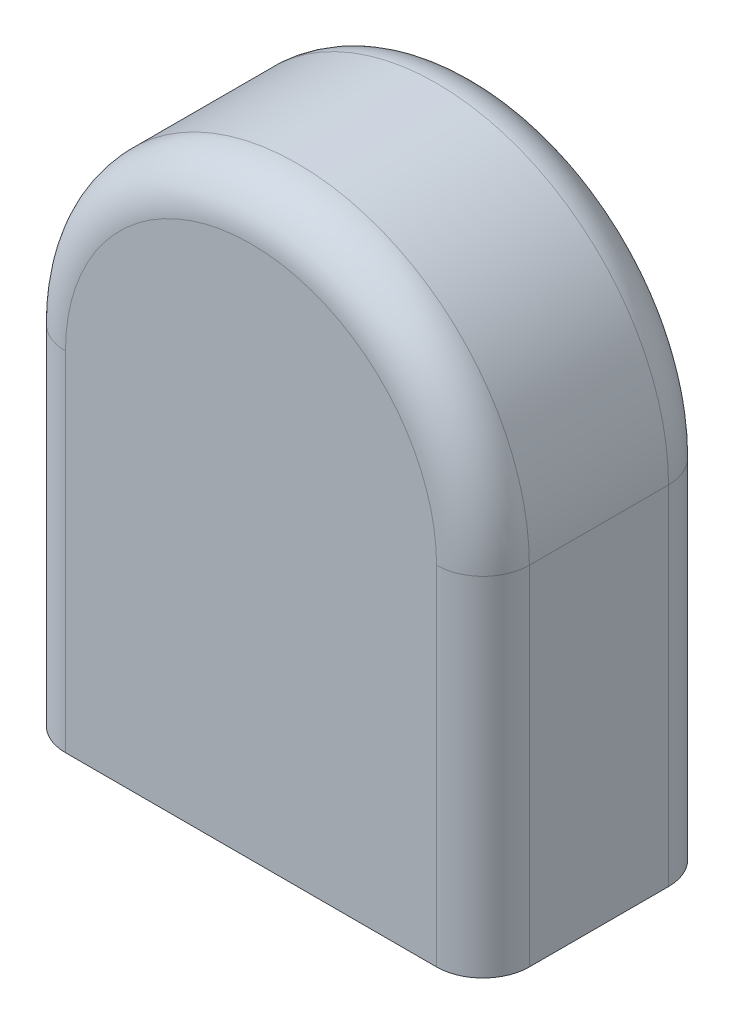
ISO-10303-21;
HEADER;
FILE_DESCRIPTION(('STEP AP214'),'2;1');
FILE_NAME('part.step','',(''),(''),'','','');
FILE_SCHEMA(('AUTOMOTIVE_DESIGN { 1 0 10303 214 1 1 1 1 }'));
ENDSEC;
DATA;
#1=APPLICATION_CONTEXT('core data for automotive mechanical design processes');
#2=APPLICATION_PROTOCOL_DEFINITION('international standard','automotive_design',2000,#1);
#3=PRODUCT_CONTEXT('',#1,'mechanical');
#4=PRODUCT('Part','Part','',(#3));
#5=PRODUCT_RELATED_PRODUCT_CATEGORY('part','',(#4));
#6=PRODUCT_DEFINITION_FORMATION('','',#4);
#7=PRODUCT_DEFINITION_CONTEXT('part definition',#1,'design');
#8=PRODUCT_DEFINITION('design','',#6,#7);
#9=PRODUCT_DEFINITION_SHAPE('','',#8);
#10=(LENGTH_UNIT() NAMED_UNIT(*) SI_UNIT(.MILLI.,.METRE.));
#11=(NAMED_UNIT(*) PLANE_ANGLE_UNIT() SI_UNIT($,.RADIAN.));
#12=(NAMED_UNIT(*) SI_UNIT($,.STERADIAN.) SOLID_ANGLE_UNIT());
#13=UNCERTAINTY_MEASURE_WITH_UNIT(LENGTH_MEASURE(1.E-05),#10,'distance_accuracy_value','');
#14=(GEOMETRIC_REPRESENTATION_CONTEXT(3) GLOBAL_UNCERTAINTY_ASSIGNED_CONTEXT((#13)) GLOBAL_UNIT_ASSIGNED_CONTEXT((#10,
#11,#12)) REPRESENTATION_CONTEXT('',''));
#15=CARTESIAN_POINT('',(0.,0.,0.));
#16=DIRECTION('',(0.,0.,1.));
#17=DIRECTION('',(1.,0.,0.));
#18=AXIS2_PLACEMENT_3D('',#15,#16,#17);
#19=CARTESIAN_POINT('',(-6.35,0.,3.175));
#20=DIRECTION('',(1.,0.,0.));
#21=DIRECTION('',(0.,1.,0.));
#22=AXIS2_PLACEMENT_3D('',#19,#20,#21);
#23=PLANE('',#22);
#24=DIRECTION('',(0.,0.,-1.));
#25=VECTOR('',#24,1.);
#26=CARTESIAN_POINT('',(-6.35,0.,3.175));
#27=LINE('',#26,#25);
#28=CARTESIAN_POINT('',(-6.35,0.,1.905));
#29=VERTEX_POINT('',#28);
#30=CARTESIAN_POINT('',(-6.35,0.,-1.905));
#31=VERTEX_POINT('',#30);
#32=EDGE_CURVE('E135',#29,#31,#27,.T.);
#33=ORIENTED_EDGE('',*,*,#32,.F.);
#34=DIRECTION('',(0.,-1.,0.));
#35=VECTOR('',#34,1.);
#36=CARTESIAN_POINT('',(-6.35,0.,1.905));
#37=LINE('',#36,#35);
#38=CARTESIAN_POINT('',(-6.35,9.525,1.905));
#39=VERTEX_POINT('',#38);
#40=EDGE_CURVE('E99',#29,#39,#37,.F.);
#41=ORIENTED_EDGE('',*,*,#40,.T.);
#42=DIRECTION('',(0.,0.,-1.));
#43=VECTOR('',#42,1.);
#44=CARTESIAN_POINT('',(-6.35,9.525,3.175));
#45=LINE('',#44,#43);
#46=CARTESIAN_POINT('',(-6.35,9.525,-1.905));
#47=VERTEX_POINT('',#46);
#48=EDGE_CURVE('E121',#39,#47,#45,.T.);
#49=ORIENTED_EDGE('',*,*,#48,.T.);
#50=DIRECTION('',(0.,-1.,0.));
#51=VECTOR('',#50,1.);
#52=CARTESIAN_POINT('',(-6.35,0.,-1.905));
#53=LINE('',#52,#51);
#54=EDGE_CURVE('E104',#47,#31,#53,.T.);
#55=ORIENTED_EDGE('',*,*,#54,.T.);
#56=EDGE_LOOP('',(#33,#41,#49,#55));
#57=FACE_BOUND('',#56,.T.);
#58=ADVANCED_FACE('F28',(#57),#23,.F.);
#59=CARTESIAN_POINT('',(-6.35,0.,3.175));
#60=DIRECTION('',(0.,1.,0.));
#61=DIRECTION('',(-1.,0.,0.));
#62=AXIS2_PLACEMENT_3D('',#59,#60,#61);
#63=PLANE('',#62);
#64=DIRECTION('',(1.,0.,0.));
#65=VECTOR('',#64,1.);
#66=CARTESIAN_POINT('',(-6.35,0.,3.175));
#67=LINE('',#66,#65);
#68=CARTESIAN_POINT('',(-5.08,0.,3.175));
#69=VERTEX_POINT('',#68);
#70=CARTESIAN_POINT('',(5.08,0.,3.175));
#71=VERTEX_POINT('',#70);
#72=EDGE_CURVE('E110',#69,#71,#67,.T.);
#73=ORIENTED_EDGE('',*,*,#72,.F.);
#74=CARTESIAN_POINT('',(-5.08,0.,1.905));
#75=DIRECTION('',(0.,1.,0.));
#76=DIRECTION('',(-1.,0.,0.));
#77=AXIS2_PLACEMENT_3D('',#74,#75,#76);
#78=CIRCLE('',#77,1.27);
#79=EDGE_CURVE('E94',#69,#29,#78,.F.);
#80=ORIENTED_EDGE('',*,*,#79,.T.);
#81=ORIENTED_EDGE('',*,*,#32,.T.);
#82=CARTESIAN_POINT('',(-5.08,0.,-1.905));
#83=DIRECTION('',(0.,1.,0.));
#84=DIRECTION('',(-1.,0.,0.));
#85=AXIS2_PLACEMENT_3D('',#82,#83,#84);
#86=CIRCLE('',#85,1.27);
#87=CARTESIAN_POINT('',(-5.08,0.,-3.175));
#88=VERTEX_POINT('',#87);
#89=EDGE_CURVE('E105',#31,#88,#86,.F.);
#90=ORIENTED_EDGE('',*,*,#89,.T.);
#91=DIRECTION('',(1.,0.,0.));
#92=VECTOR('',#91,1.);
#93=CARTESIAN_POINT('',(-6.35,0.,-3.175));
#94=LINE('',#93,#92);
#95=CARTESIAN_POINT('',(5.08,0.,-3.175));
#96=VERTEX_POINT('',#95);
#97=EDGE_CURVE('E122',#88,#96,#94,.T.);
#98=ORIENTED_EDGE('',*,*,#97,.T.);
#99=CARTESIAN_POINT('',(5.08,0.,-1.905));
#100=DIRECTION('',(0.,1.,0.));
#101=DIRECTION('',(-1.,0.,0.));
#102=AXIS2_PLACEMENT_3D('',#99,#100,#101);
#103=CIRCLE('',#102,1.27);
#104=CARTESIAN_POINT('',(6.35,0.,-1.905));
#105=VERTEX_POINT('',#104);
#106=EDGE_CURVE('E115',#96,#105,#103,.F.);
#107=ORIENTED_EDGE('',*,*,#106,.T.);
#108=DIRECTION('',(0.,0.,-1.));
#109=VECTOR('',#108,1.);
#110=CARTESIAN_POINT('',(6.35,0.,3.175));
#111=LINE('',#110,#109);
#112=CARTESIAN_POINT('',(6.35,0.,1.905));
#113=VERTEX_POINT('',#112);
#114=EDGE_CURVE('E133',#113,#105,#111,.T.);
#115=ORIENTED_EDGE('',*,*,#114,.F.);
#116=CARTESIAN_POINT('',(5.08,0.,1.905));
#117=DIRECTION('',(0.,1.,0.));
#118=DIRECTION('',(-1.,0.,0.));
#119=AXIS2_PLACEMENT_3D('',#116,#117,#118);
#120=CIRCLE('',#119,1.27);
#121=EDGE_CURVE('E120',#113,#71,#120,.F.);
#122=ORIENTED_EDGE('',*,*,#121,.T.);
#123=EDGE_LOOP('',(#73,#80,#81,#90,#98,#107,#115,#122));
#124=FACE_BOUND('',#123,.T.);
#125=ADVANCED_FACE('F117',(#124),#63,.F.);
#126=CARTESIAN_POINT('',(6.35,0.,3.175));
#127=DIRECTION('',(-1.,0.,0.));
#128=DIRECTION('',(0.,-1.,0.));
#129=AXIS2_PLACEMENT_3D('',#126,#127,#128);
#130=PLANE('',#129);
#131=DIRECTION('',(0.,0.,-1.));
#132=VECTOR('',#131,1.);
#133=CARTESIAN_POINT('',(6.35,9.525,3.175));
#134=LINE('',#133,#132);
#135=CARTESIAN_POINT('',(6.35,9.525,1.905));
#136=VERTEX_POINT('',#135);
#137=CARTESIAN_POINT('',(6.35,9.525,-1.905));
#138=VERTEX_POINT('',#137);
#139=EDGE_CURVE('E125',#136,#138,#134,.T.);
#140=ORIENTED_EDGE('',*,*,#139,.F.);
#141=DIRECTION('',(0.,1.,0.));
#142=VECTOR('',#141,1.);
#143=CARTESIAN_POINT('',(6.35,0.,1.905));
#144=LINE('',#143,#142);
#145=EDGE_CURVE('E156',#136,#113,#144,.F.);
#146=ORIENTED_EDGE('',*,*,#145,.T.);
#147=ORIENTED_EDGE('',*,*,#114,.T.);
#148=DIRECTION('',(0.,1.,0.));
#149=VECTOR('',#148,1.);
#150=CARTESIAN_POINT('',(6.35,9.525,-1.905));
#151=LINE('',#150,#149);
#152=EDGE_CURVE('E42',#105,#138,#151,.T.);
#153=ORIENTED_EDGE('',*,*,#152,.T.);
#154=EDGE_LOOP('',(#140,#146,#147,#153));
#155=FACE_BOUND('',#154,.T.);
#156=ADVANCED_FACE('F195',(#155),#130,.F.);
#157=CARTESIAN_POINT('',(0.,9.525,3.175));
#158=DIRECTION('',(0.,0.,-1.));
#159=DIRECTION('',(-1.,0.,0.));
#160=AXIS2_PLACEMENT_3D('',#157,#158,#159);
#161=CYLINDRICAL_SURFACE('',#160,6.35);
#162=ORIENTED_EDGE('',*,*,#48,.F.);
#163=CARTESIAN_POINT('',(0.,9.525,1.905));
#164=DIRECTION('',(0.,0.,-1.));
#165=DIRECTION('',(-1.,0.,0.));
#166=AXIS2_PLACEMENT_3D('',#163,#164,#165);
#167=CIRCLE('',#166,6.35);
#168=EDGE_CURVE('E49',#39,#136,#167,.T.);
#169=ORIENTED_EDGE('',*,*,#168,.T.);
#170=ORIENTED_EDGE('',*,*,#139,.T.);
#171=CARTESIAN_POINT('',(0.,9.525,-1.905));
#172=DIRECTION('',(0.,0.,-1.));
#173=DIRECTION('',(-1.,0.,0.));
#174=AXIS2_PLACEMENT_3D('',#171,#172,#173);
#175=CIRCLE('',#174,6.35);
#176=EDGE_CURVE('E152',#138,#47,#175,.F.);
#177=ORIENTED_EDGE('',*,*,#176,.T.);
#178=EDGE_LOOP('',(#162,#169,#170,#177));
#179=FACE_BOUND('',#178,.T.);
#180=ADVANCED_FACE('F223',(#179),#161,.T.);
#181=CARTESIAN_POINT('',(0.,9.525,3.175));
#182=DIRECTION('',(0.,0.,-1.));
#183=DIRECTION('',(-1.,0.,0.));
#184=AXIS2_PLACEMENT_3D('',#181,#182,#183);
#185=PLANE('',#184);
#186=CARTESIAN_POINT('',(0.,9.525,3.175));
#187=DIRECTION('',(0.,0.,-1.));
#188=DIRECTION('',(-1.,0.,0.));
#189=AXIS2_PLACEMENT_3D('',#186,#187,#188);
#190=CIRCLE('',#189,5.08);
#191=CARTESIAN_POINT('',(5.08,9.525,3.175));
#192=VERTEX_POINT('',#191);
#193=CARTESIAN_POINT('',(-5.08,9.525,3.175));
#194=VERTEX_POINT('',#193);
#195=EDGE_CURVE('E113',#192,#194,#190,.F.);
#196=ORIENTED_EDGE('',*,*,#195,.T.);
#197=DIRECTION('',(0.,-1.,0.));
#198=VECTOR('',#197,1.);
#199=CARTESIAN_POINT('',(-5.08,9.525,3.175));
#200=LINE('',#199,#198);
#201=EDGE_CURVE('E98',#194,#69,#200,.T.);
#202=ORIENTED_EDGE('',*,*,#201,.T.);
#203=ORIENTED_EDGE('',*,*,#72,.T.);
#204=DIRECTION('',(0.,1.,0.));
#205=VECTOR('',#204,1.);
#206=CARTESIAN_POINT('',(5.08,9.525,3.175));
#207=LINE('',#206,#205);
#208=EDGE_CURVE('E137',#71,#192,#207,.T.);
#209=ORIENTED_EDGE('',*,*,#208,.T.);
#210=EDGE_LOOP('',(#196,#202,#203,#209));
#211=FACE_BOUND('',#210,.T.);
#212=ADVANCED_FACE('F109',(#211),#185,.F.);
#213=CARTESIAN_POINT('',(0.,9.525,-3.175));
#214=DIRECTION('',(0.,0.,-1.));
#215=DIRECTION('',(-1.,0.,0.));
#216=AXIS2_PLACEMENT_3D('',#213,#214,#215);
#217=PLANE('',#216);
#218=CARTESIAN_POINT('',(0.,9.525,-3.175));
#219=DIRECTION('',(0.,0.,-1.));
#220=DIRECTION('',(-1.,0.,0.));
#221=AXIS2_PLACEMENT_3D('',#218,#219,#220);
#222=CIRCLE('',#221,3.81);
#223=CARTESIAN_POINT('',(-3.81,9.525,-3.175));
#224=VERTEX_POINT('',#223);
#225=EDGE_CURVE('E11',#224,#224,#222,.F.);
#226=ORIENTED_EDGE('',*,*,#225,.T.);
#227=EDGE_LOOP('',(#226));
#228=FACE_BOUND('',#227,.T.);
#229=ORIENTED_EDGE('',*,*,#97,.F.);
#230=DIRECTION('',(0.,-1.,0.));
#231=VECTOR('',#230,1.);
#232=CARTESIAN_POINT('',(-5.08,9.525,-3.175));
#233=LINE('',#232,#231);
#234=CARTESIAN_POINT('',(-5.08,9.525,-3.175));
#235=VERTEX_POINT('',#234);
#236=EDGE_CURVE('E150',#88,#235,#233,.F.);
#237=ORIENTED_EDGE('',*,*,#236,.T.);
#238=CARTESIAN_POINT('',(0.,9.525,-3.175));
#239=DIRECTION('',(0.,0.,-1.));
#240=DIRECTION('',(-1.,0.,0.));
#241=AXIS2_PLACEMENT_3D('',#238,#239,#240);
#242=CIRCLE('',#241,5.08);
#243=CARTESIAN_POINT('',(5.08,9.525,-3.175));
#244=VERTEX_POINT('',#243);
#245=EDGE_CURVE('E148',#235,#244,#242,.T.);
#246=ORIENTED_EDGE('',*,*,#245,.T.);
#247=DIRECTION('',(0.,1.,0.));
#248=VECTOR('',#247,1.);
#249=CARTESIAN_POINT('',(5.08,0.,-3.175));
#250=LINE('',#249,#248);
#251=EDGE_CURVE('E146',#244,#96,#250,.F.);
#252=ORIENTED_EDGE('',*,*,#251,.T.);
#253=EDGE_LOOP('',(#229,#237,#246,#252));
#254=FACE_BOUND('',#253,.T.);
#255=ADVANCED_FACE('F188',(#228,#254),#217,.T.);
#256=CARTESIAN_POINT('',(0.,9.525,0.));
#257=DIRECTION('',(0.,0.,-1.));
#258=DIRECTION('',(-1.,0.,0.));
#259=AXIS2_PLACEMENT_3D('',#256,#257,#258);
#260=CYLINDRICAL_SURFACE('',#259,3.175);
#261=CARTESIAN_POINT('',(0.,9.525,-0.635));
#262=DIRECTION('',(0.,0.,-1.));
#263=DIRECTION('',(-1.,0.,0.));
#264=AXIS2_PLACEMENT_3D('',#261,#262,#263);
#265=CIRCLE('',#264,3.175);
#266=CARTESIAN_POINT('',(-3.175,9.525,-0.635));
#267=VERTEX_POINT('',#266);
#268=EDGE_CURVE('E35',#267,#267,#265,.F.);
#269=ORIENTED_EDGE('',*,*,#268,.T.);
#270=EDGE_LOOP('',(#269));
#271=FACE_BOUND('',#270,.T.);
#272=CARTESIAN_POINT('',(0.,9.525,-2.54));
#273=DIRECTION('',(0.,0.,-1.));
#274=DIRECTION('',(-1.,0.,0.));
#275=AXIS2_PLACEMENT_3D('',#272,#273,#274);
#276=CIRCLE('',#275,3.175);
#277=CARTESIAN_POINT('',(-3.175,9.525,-2.54));
#278=VERTEX_POINT('',#277);
#279=EDGE_CURVE('E161',#278,#278,#276,.T.);
#280=ORIENTED_EDGE('',*,*,#279,.T.);
#281=EDGE_LOOP('',(#280));
#282=FACE_BOUND('',#281,.T.);
#283=ADVANCED_FACE('F166',(#271,#282),#260,.F.);
#284=CARTESIAN_POINT('',(0.,9.525,0.));
#285=DIRECTION('',(0.,0.,-1.));
#286=DIRECTION('',(-1.,0.,0.));
#287=AXIS2_PLACEMENT_3D('',#284,#285,#286);
#288=PLANE('',#287);
#289=CARTESIAN_POINT('',(0.,9.525,0.));
#290=DIRECTION('',(0.,0.,-1.));
#291=DIRECTION('',(-1.,0.,0.));
#292=AXIS2_PLACEMENT_3D('',#289,#290,#291);
#293=CIRCLE('',#292,2.54);
#294=CARTESIAN_POINT('',(-2.54,9.525,0.));
#295=VERTEX_POINT('',#294);
#296=EDGE_CURVE('E158',#295,#295,#293,.T.);
#297=ORIENTED_EDGE('',*,*,#296,.T.);
#298=EDGE_LOOP('',(#297));
#299=FACE_BOUND('',#298,.T.);
#300=ADVANCED_FACE('F177',(#299),#288,.T.);
#301=CARTESIAN_POINT('',(5.08,9.525,1.905));
#302=DIRECTION('',(0.,1.,0.));
#303=DIRECTION('',(-1.,0.,0.));
#304=AXIS2_PLACEMENT_3D('',#301,#302,#303);
#305=CYLINDRICAL_SURFACE('',#304,1.27);
#306=ORIENTED_EDGE('',*,*,#121,.F.);
#307=ORIENTED_EDGE('',*,*,#145,.F.);
#308=CARTESIAN_POINT('',(5.08,9.525,1.905));
#309=DIRECTION('',(0.,1.,0.));
#310=DIRECTION('',(0.,0.,1.));
#311=AXIS2_PLACEMENT_3D('',#308,#309,#310);
#312=CIRCLE('',#311,1.27);
#313=EDGE_CURVE('E128',#192,#136,#312,.T.);
#314=ORIENTED_EDGE('',*,*,#313,.F.);
#315=ORIENTED_EDGE('',*,*,#208,.F.);
#316=EDGE_LOOP('',(#306,#307,#314,#315));
#317=FACE_BOUND('',#316,.T.);
#318=ADVANCED_FACE('F179',(#317),#305,.T.);
#319=CARTESIAN_POINT('',(0.,9.525,1.905));
#320=DIRECTION('',(0.,0.,-1.));
#321=DIRECTION('',(-1.,0.,0.));
#322=AXIS2_PLACEMENT_3D('',#319,#320,#321);
#323=TOROIDAL_SURFACE('',#322,5.08,1.27);
#324=ORIENTED_EDGE('',*,*,#313,.T.);
#325=ORIENTED_EDGE('',*,*,#168,.F.);
#326=CARTESIAN_POINT('',(-5.08,9.525,1.905));
#327=DIRECTION('',(0.,-1.,0.));
#328=DIRECTION('',(0.,0.,-1.));
#329=AXIS2_PLACEMENT_3D('',#326,#327,#328);
#330=CIRCLE('',#329,1.27);
#331=EDGE_CURVE('E212',#194,#39,#330,.T.);
#332=ORIENTED_EDGE('',*,*,#331,.F.);
#333=ORIENTED_EDGE('',*,*,#195,.F.);
#334=EDGE_LOOP('',(#324,#325,#332,#333));
#335=FACE_BOUND('',#334,.T.);
#336=ADVANCED_FACE('F185',(#335),#323,.T.);
#337=CARTESIAN_POINT('',(-5.08,9.525,1.905));
#338=DIRECTION('',(0.,-1.,0.));
#339=DIRECTION('',(1.,0.,0.));
#340=AXIS2_PLACEMENT_3D('',#337,#338,#339);
#341=CYLINDRICAL_SURFACE('',#340,1.27);
#342=ORIENTED_EDGE('',*,*,#331,.T.);
#343=ORIENTED_EDGE('',*,*,#40,.F.);
#344=ORIENTED_EDGE('',*,*,#79,.F.);
#345=ORIENTED_EDGE('',*,*,#201,.F.);
#346=EDGE_LOOP('',(#342,#343,#344,#345));
#347=FACE_BOUND('',#346,.T.);
#348=ADVANCED_FACE('F97',(#347),#341,.T.);
#349=CARTESIAN_POINT('',(5.08,0.,-1.905));
#350=DIRECTION('',(0.,-1.,0.));
#351=DIRECTION('',(1.,0.,0.));
#352=AXIS2_PLACEMENT_3D('',#349,#350,#351);
#353=CYLINDRICAL_SURFACE('',#352,1.27);
#354=ORIENTED_EDGE('',*,*,#106,.F.);
#355=ORIENTED_EDGE('',*,*,#251,.F.);
#356=CARTESIAN_POINT('',(5.08,9.525,-1.905));
#357=DIRECTION('',(0.,1.,0.));
#358=DIRECTION('',(0.,0.,1.));
#359=AXIS2_PLACEMENT_3D('',#356,#357,#358);
#360=CIRCLE('',#359,1.27);
#361=EDGE_CURVE('E209',#138,#244,#360,.T.);
#362=ORIENTED_EDGE('',*,*,#361,.F.);
#363=ORIENTED_EDGE('',*,*,#152,.F.);
#364=EDGE_LOOP('',(#354,#355,#362,#363));
#365=FACE_BOUND('',#364,.T.);
#366=ADVANCED_FACE('F220',(#365),#353,.T.);
#367=CARTESIAN_POINT('',(0.,9.525,-1.905));
#368=DIRECTION('',(0.,0.,-1.));
#369=DIRECTION('',(-1.,0.,0.));
#370=AXIS2_PLACEMENT_3D('',#367,#368,#369);
#371=TOROIDAL_SURFACE('',#370,5.08,1.27);
#372=ORIENTED_EDGE('',*,*,#361,.T.);
#373=ORIENTED_EDGE('',*,*,#245,.F.);
#374=CARTESIAN_POINT('',(-5.08,9.525,-1.905));
#375=DIRECTION('',(0.,-1.,0.));
#376=DIRECTION('',(0.,0.,-1.));
#377=AXIS2_PLACEMENT_3D('',#374,#375,#376);
#378=CIRCLE('',#377,1.27);
#379=EDGE_CURVE('E206',#47,#235,#378,.T.);
#380=ORIENTED_EDGE('',*,*,#379,.F.);
#381=ORIENTED_EDGE('',*,*,#176,.F.);
#382=EDGE_LOOP('',(#372,#373,#380,#381));
#383=FACE_BOUND('',#382,.T.);
#384=ADVANCED_FACE('F222',(#383),#371,.T.);
#385=CARTESIAN_POINT('',(-5.08,0.,-1.905));
#386=DIRECTION('',(0.,1.,0.));
#387=DIRECTION('',(-1.,0.,0.));
#388=AXIS2_PLACEMENT_3D('',#385,#386,#387);
#389=CYLINDRICAL_SURFACE('',#388,1.27);
#390=ORIENTED_EDGE('',*,*,#379,.T.);
#391=ORIENTED_EDGE('',*,*,#236,.F.);
#392=ORIENTED_EDGE('',*,*,#89,.F.);
#393=ORIENTED_EDGE('',*,*,#54,.F.);
#394=EDGE_LOOP('',(#390,#391,#392,#393));
#395=FACE_BOUND('',#394,.T.);
#396=ADVANCED_FACE('F173',(#395),#389,.T.);
#397=CARTESIAN_POINT('',(0.,9.525,-0.635));
#398=DIRECTION('',(0.,0.,-1.));
#399=DIRECTION('',(-1.,0.,0.));
#400=AXIS2_PLACEMENT_3D('',#397,#398,#399);
#401=TOROIDAL_SURFACE('',#400,2.54,0.635);
#402=ORIENTED_EDGE('',*,*,#268,.F.);
#403=EDGE_LOOP('',(#402));
#404=FACE_BOUND('',#403,.T.);
#405=ORIENTED_EDGE('',*,*,#296,.F.);
#406=EDGE_LOOP('',(#405));
#407=FACE_BOUND('',#406,.T.);
#408=ADVANCED_FACE('F169',(#404,#407),#401,.F.);
#409=CARTESIAN_POINT('',(0.,9.525,-2.54));
#410=DIRECTION('',(0.,0.,-1.));
#411=DIRECTION('',(-1.,0.,0.));
#412=AXIS2_PLACEMENT_3D('',#409,#410,#411);
#413=TOROIDAL_SURFACE('',#412,3.81,0.635);
#414=ORIENTED_EDGE('',*,*,#225,.F.);
#415=EDGE_LOOP('',(#414));
#416=FACE_BOUND('',#415,.T.);
#417=ORIENTED_EDGE('',*,*,#279,.F.);
#418=EDGE_LOOP('',(#417));
#419=FACE_BOUND('',#418,.T.);
#420=ADVANCED_FACE('F172',(#416,#419),#413,.T.);
#421=CLOSED_SHELL('',(#58,#125,#156,#180,#212,#255,#283,#300,#318,#336,#348,#366,#384,#396,#408,#420));
#422=MANIFOLD_SOLID_BREP('B2',#421);
#423=ADVANCED_BREP_SHAPE_REPRESENTATION('',(#18,#422),#14);
#424=SHAPE_DEFINITION_REPRESENTATION(#9,#423);
ENDSEC;
END-ISO-10303-21;
